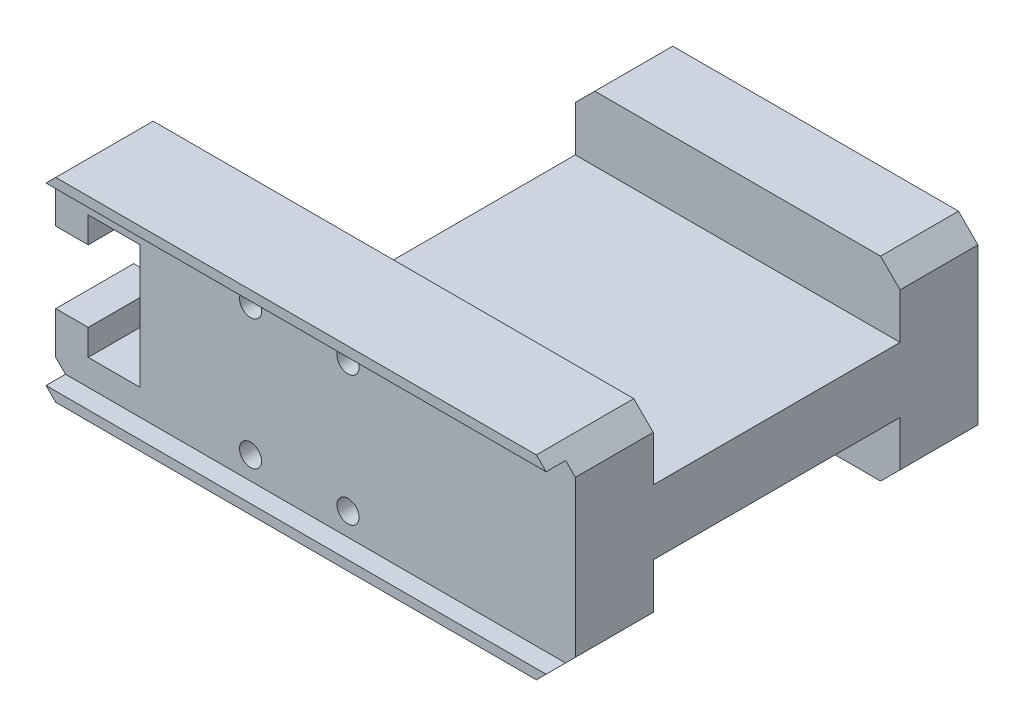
ISO-10303-21;
HEADER;
FILE_DESCRIPTION(('STEP AP214'),'2;1');
FILE_NAME('part.step','',(''),(''),'','','');
FILE_SCHEMA(('AUTOMOTIVE_DESIGN { 1 0 10303 214 1 1 1 1 }'));
ENDSEC;
DATA;
#1=APPLICATION_CONTEXT('core data for automotive mechanical design processes');
#2=APPLICATION_PROTOCOL_DEFINITION('international standard','automotive_design',2000,#1);
#3=PRODUCT_CONTEXT('',#1,'mechanical');
#4=PRODUCT('Part','Part','',(#3));
#5=PRODUCT_RELATED_PRODUCT_CATEGORY('part','',(#4));
#6=PRODUCT_DEFINITION_FORMATION('','',#4);
#7=PRODUCT_DEFINITION_CONTEXT('part definition',#1,'design');
#8=PRODUCT_DEFINITION('design','',#6,#7);
#9=PRODUCT_DEFINITION_SHAPE('','',#8);
#10=(LENGTH_UNIT() NAMED_UNIT(*) SI_UNIT(.MILLI.,.METRE.));
#11=(NAMED_UNIT(*) PLANE_ANGLE_UNIT() SI_UNIT($,.RADIAN.));
#12=(NAMED_UNIT(*) SI_UNIT($,.STERADIAN.) SOLID_ANGLE_UNIT());
#13=UNCERTAINTY_MEASURE_WITH_UNIT(LENGTH_MEASURE(1.E-05),#10,'distance_accuracy_value','');
#14=(GEOMETRIC_REPRESENTATION_CONTEXT(3) GLOBAL_UNCERTAINTY_ASSIGNED_CONTEXT((#13)) GLOBAL_UNIT_ASSIGNED_CONTEXT((#10,
#11,#12)) REPRESENTATION_CONTEXT('',''));
#15=CARTESIAN_POINT('',(0.,0.,0.));
#16=DIRECTION('',(0.,0.,1.));
#17=DIRECTION('',(1.,0.,0.));
#18=AXIS2_PLACEMENT_3D('',#15,#16,#17);
#19=CARTESIAN_POINT('',(-40.,15.,32.5));
#20=DIRECTION('',(0.,-1.,0.));
#21=DIRECTION('',(0.,0.,-1.));
#22=AXIS2_PLACEMENT_3D('',#19,#20,#21);
#23=PLANE('',#22);
#24=DIRECTION('',(-1.,0.,0.));
#25=VECTOR('',#24,1.);
#26=CARTESIAN_POINT('',(-40.,15.,-32.5));
#27=LINE('',#26,#25);
#28=CARTESIAN_POINT('',(37.,15.,-32.5));
#29=VERTEX_POINT('',#28);
#30=CARTESIAN_POINT('',(-6.99999999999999,15.,-32.5));
#31=VERTEX_POINT('',#30);
#32=EDGE_CURVE('E407',#29,#31,#27,.T.);
#33=ORIENTED_EDGE('',*,*,#32,.T.);
#34=DIRECTION('',(0.,0.,1.));
#35=VECTOR('',#34,1.);
#36=CARTESIAN_POINT('',(-6.99999999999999,15.,-20.5));
#37=LINE('',#36,#35);
#38=CARTESIAN_POINT('',(-6.99999999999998,15.,-20.5));
#39=VERTEX_POINT('',#38);
#40=EDGE_CURVE('E456',#31,#39,#37,.T.);
#41=ORIENTED_EDGE('',*,*,#40,.T.);
#42=DIRECTION('',(1.,0.,0.));
#43=VECTOR('',#42,1.);
#44=CARTESIAN_POINT('',(-51.8579962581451,15.,-20.5));
#45=LINE('',#44,#43);
#46=CARTESIAN_POINT('',(37.,15.,-20.5));
#47=VERTEX_POINT('',#46);
#48=EDGE_CURVE('E278',#39,#47,#45,.T.);
#49=ORIENTED_EDGE('',*,*,#48,.T.);
#50=DIRECTION('',(0.,0.,-1.));
#51=VECTOR('',#50,1.);
#52=CARTESIAN_POINT('',(37.,15.,32.5));
#53=LINE('',#52,#51);
#54=EDGE_CURVE('E453',#47,#29,#53,.T.);
#55=ORIENTED_EDGE('',*,*,#54,.T.);
#56=EDGE_LOOP('',(#33,#41,#49,#55));
#57=FACE_BOUND('',#56,.T.);
#58=ADVANCED_FACE('F37',(#57),#23,.F.);
#59=CARTESIAN_POINT('',(-27.,-9.5,32.5));
#60=DIRECTION('',(1.,0.,0.));
#61=DIRECTION('',(0.,0.,-1.));
#62=AXIS2_PLACEMENT_3D('',#59,#60,#61);
#63=PLANE('',#62);
#64=DIRECTION('',(0.,0.,-1.));
#65=VECTOR('',#64,1.);
#66=CARTESIAN_POINT('',(-27.,9.5,32.5));
#67=LINE('',#66,#65);
#68=CARTESIAN_POINT('',(-27.,9.5,29.5));
#69=VERTEX_POINT('',#68);
#70=CARTESIAN_POINT('',(-27.,9.5,17.5));
#71=VERTEX_POINT('',#70);
#72=EDGE_CURVE('E357',#69,#71,#67,.T.);
#73=ORIENTED_EDGE('',*,*,#72,.T.);
#74=DIRECTION('',(0.,-1.,0.));
#75=VECTOR('',#74,1.);
#76=CARTESIAN_POINT('',(-27.,-9.5,17.5));
#77=LINE('',#76,#75);
#78=CARTESIAN_POINT('',(-27.,-9.5,17.5));
#79=VERTEX_POINT('',#78);
#80=EDGE_CURVE('E329',#71,#79,#77,.T.);
#81=ORIENTED_EDGE('',*,*,#80,.T.);
#82=DIRECTION('',(0.,0.,-1.));
#83=VECTOR('',#82,1.);
#84=CARTESIAN_POINT('',(-27.,-9.5,32.5));
#85=LINE('',#84,#83);
#86=CARTESIAN_POINT('',(-27.,-9.5,29.5));
#87=VERTEX_POINT('',#86);
#88=EDGE_CURVE('E354',#87,#79,#85,.T.);
#89=ORIENTED_EDGE('',*,*,#88,.F.);
#90=DIRECTION('',(0.,-1.,0.));
#91=VECTOR('',#90,1.);
#92=CARTESIAN_POINT('',(-27.,13.5,29.5));
#93=LINE('',#92,#91);
#94=EDGE_CURVE('E428',#69,#87,#93,.T.);
#95=ORIENTED_EDGE('',*,*,#94,.F.);
#96=EDGE_LOOP('',(#73,#81,#89,#95));
#97=FACE_BOUND('',#96,.T.);
#98=ADVANCED_FACE('F579',(#97),#63,.F.);
#99=CARTESIAN_POINT('',(-40.,-15.,32.5));
#100=DIRECTION('',(0.,1.,0.));
#101=DIRECTION('',(0.,0.,1.));
#102=AXIS2_PLACEMENT_3D('',#99,#100,#101);
#103=PLANE('',#102);
#104=DIRECTION('',(1.,0.,0.));
#105=VECTOR('',#104,1.);
#106=CARTESIAN_POINT('',(-51.8579962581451,-15.,-20.5));
#107=LINE('',#106,#105);
#108=CARTESIAN_POINT('',(-6.99999999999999,-15.,-20.5));
#109=VERTEX_POINT('',#108);
#110=CARTESIAN_POINT('',(37.,-15.,-20.5));
#111=VERTEX_POINT('',#110);
#112=EDGE_CURVE('E307',#109,#111,#107,.T.);
#113=ORIENTED_EDGE('',*,*,#112,.F.);
#114=DIRECTION('',(0.,0.,-1.));
#115=VECTOR('',#114,1.);
#116=CARTESIAN_POINT('',(-6.99999999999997,-15.,-32.5));
#117=LINE('',#116,#115);
#118=CARTESIAN_POINT('',(-6.99999999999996,-15.,-32.5));
#119=VERTEX_POINT('',#118);
#120=EDGE_CURVE('E468',#109,#119,#117,.T.);
#121=ORIENTED_EDGE('',*,*,#120,.T.);
#122=DIRECTION('',(1.,0.,0.));
#123=VECTOR('',#122,1.);
#124=CARTESIAN_POINT('',(-40.,-15.,-32.5));
#125=LINE('',#124,#123);
#126=CARTESIAN_POINT('',(37.,-15.,-32.5));
#127=VERTEX_POINT('',#126);
#128=EDGE_CURVE('E402',#119,#127,#125,.T.);
#129=ORIENTED_EDGE('',*,*,#128,.T.);
#130=DIRECTION('',(0.,0.,1.));
#131=VECTOR('',#130,1.);
#132=CARTESIAN_POINT('',(37.,-15.,32.5));
#133=LINE('',#132,#131);
#134=EDGE_CURVE('E466',#127,#111,#133,.T.);
#135=ORIENTED_EDGE('',*,*,#134,.T.);
#136=EDGE_LOOP('',(#113,#121,#129,#135));
#137=FACE_BOUND('',#136,.T.);
#138=ADVANCED_FACE('F556',(#137),#103,.F.);
#139=CARTESIAN_POINT('',(40.,15.,-32.5));
#140=DIRECTION('',(0.,0.,-1.));
#141=DIRECTION('',(-1.,0.,0.));
#142=AXIS2_PLACEMENT_3D('',#139,#140,#141);
#143=PLANE('',#142);
#144=CARTESIAN_POINT('',(10.,0.,-32.5));
#145=DIRECTION('',(0.,0.,-1.));
#146=DIRECTION('',(-1.,0.,0.));
#147=AXIS2_PLACEMENT_3D('',#144,#145,#146);
#148=CIRCLE('',#147,2.1);
#149=CARTESIAN_POINT('',(7.90000000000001,0.,-32.5));
#150=VERTEX_POINT('',#149);
#151=EDGE_CURVE('E343',#150,#150,#148,.T.);
#152=ORIENTED_EDGE('',*,*,#151,.F.);
#153=EDGE_LOOP('',(#152));
#154=FACE_BOUND('',#153,.T.);
#155=DIRECTION('',(0.,1.,0.));
#156=VECTOR('',#155,1.);
#157=CARTESIAN_POINT('',(-9.99999999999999,42.714272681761,-32.5));
#158=LINE('',#157,#156);
#159=CARTESIAN_POINT('',(-9.99999999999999,-12.,-32.5));
#160=VERTEX_POINT('',#159);
#161=CARTESIAN_POINT('',(-9.99999999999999,12.,-32.5));
#162=VERTEX_POINT('',#161);
#163=EDGE_CURVE('E262',#160,#162,#158,.T.);
#164=ORIENTED_EDGE('',*,*,#163,.T.);
#165=DIRECTION('',(0.707106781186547,0.707106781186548,0.));
#166=VECTOR('',#165,1.);
#167=CARTESIAN_POINT('',(16.5,38.5,-32.5));
#168=LINE('',#167,#166);
#169=EDGE_CURVE('E451',#162,#31,#168,.T.);
#170=ORIENTED_EDGE('',*,*,#169,.T.);
#171=ORIENTED_EDGE('',*,*,#32,.F.);
#172=DIRECTION('',(-0.707106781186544,0.707106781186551,0.));
#173=VECTOR('',#172,1.);
#174=CARTESIAN_POINT('',(38.5,13.5,-32.5));
#175=LINE('',#174,#173);
#176=CARTESIAN_POINT('',(40.,12.,-32.5));
#177=VERTEX_POINT('',#176);
#178=EDGE_CURVE('E447',#29,#177,#175,.F.);
#179=ORIENTED_EDGE('',*,*,#178,.T.);
#180=DIRECTION('',(0.,1.,0.));
#181=VECTOR('',#180,1.);
#182=CARTESIAN_POINT('',(40.,-15.,-32.5));
#183=LINE('',#182,#181);
#184=CARTESIAN_POINT('',(40.,-12.,-32.5));
#185=VERTEX_POINT('',#184);
#186=EDGE_CURVE('E397',#185,#177,#183,.T.);
#187=ORIENTED_EDGE('',*,*,#186,.F.);
#188=DIRECTION('',(0.707106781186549,0.707106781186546,0.));
#189=VECTOR('',#188,1.);
#190=CARTESIAN_POINT('',(53.5,1.49999999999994,-32.5));
#191=LINE('',#190,#189);
#192=EDGE_CURVE('E445',#185,#127,#191,.F.);
#193=ORIENTED_EDGE('',*,*,#192,.T.);
#194=ORIENTED_EDGE('',*,*,#128,.F.);
#195=DIRECTION('',(-0.707106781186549,0.707106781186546,0.));
#196=VECTOR('',#195,1.);
#197=CARTESIAN_POINT('',(1.50000000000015,-23.5000000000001,-32.5));
#198=LINE('',#197,#196);
#199=EDGE_CURVE('E449',#119,#160,#198,.T.);
#200=ORIENTED_EDGE('',*,*,#199,.T.);
#201=EDGE_LOOP('',(#164,#170,#171,#179,#187,#193,#194,#200));
#202=FACE_BOUND('',#201,.T.);
#203=ADVANCED_FACE('F552',(#154,#202),#143,.T.);
#204=CARTESIAN_POINT('',(-51.8579962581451,-5.,-20.5));
#205=DIRECTION('',(0.,-1.,0.));
#206=DIRECTION('',(0.,0.,-1.));
#207=AXIS2_PLACEMENT_3D('',#204,#205,#206);
#208=PLANE('',#207);
#209=DIRECTION('',(-1.,0.,0.));
#210=VECTOR('',#209,1.);
#211=CARTESIAN_POINT('',(-51.8579962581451,-5.,17.5));
#212=LINE('',#211,#210);
#213=CARTESIAN_POINT('',(40.,-5.,17.5));
#214=VERTEX_POINT('',#213);
#215=CARTESIAN_POINT('',(-9.99999999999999,-5.,17.5));
#216=VERTEX_POINT('',#215);
#217=EDGE_CURVE('E310',#214,#216,#212,.T.);
#218=ORIENTED_EDGE('',*,*,#217,.T.);
#219=DIRECTION('',(0.,0.,-1.));
#220=VECTOR('',#219,1.);
#221=CARTESIAN_POINT('',(-9.99999999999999,-5.,-20.5));
#222=LINE('',#221,#220);
#223=CARTESIAN_POINT('',(-9.99999999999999,-5.,-20.5));
#224=VERTEX_POINT('',#223);
#225=EDGE_CURVE('E256',#216,#224,#222,.T.);
#226=ORIENTED_EDGE('',*,*,#225,.T.);
#227=DIRECTION('',(1.,0.,0.));
#228=VECTOR('',#227,1.);
#229=CARTESIAN_POINT('',(-51.8579962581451,-5.,-20.5));
#230=LINE('',#229,#228);
#231=CARTESIAN_POINT('',(40.,-5.,-20.5));
#232=VERTEX_POINT('',#231);
#233=EDGE_CURVE('E308',#224,#232,#230,.T.);
#234=ORIENTED_EDGE('',*,*,#233,.T.);
#235=DIRECTION('',(0.,0.,1.));
#236=VECTOR('',#235,1.);
#237=CARTESIAN_POINT('',(40.,-5.,32.5));
#238=LINE('',#237,#236);
#239=EDGE_CURVE('E340',#232,#214,#238,.T.);
#240=ORIENTED_EDGE('',*,*,#239,.T.);
#241=EDGE_LOOP('',(#218,#226,#234,#240));
#242=FACE_BOUND('',#241,.T.);
#243=ADVANCED_FACE('F539',(#242),#208,.T.);
#244=CARTESIAN_POINT('',(-51.8579962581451,-5.,-20.5));
#245=DIRECTION('',(0.,0.,-1.));
#246=DIRECTION('',(-1.,0.,0.));
#247=AXIS2_PLACEMENT_3D('',#244,#245,#246);
#248=PLANE('',#247);
#249=DIRECTION('',(0.,1.,0.));
#250=VECTOR('',#249,1.);
#251=CARTESIAN_POINT('',(-9.99999999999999,-4.99999999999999,-20.5));
#252=LINE('',#251,#250);
#253=CARTESIAN_POINT('',(-9.99999999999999,-12.,-20.5));
#254=VERTEX_POINT('',#253);
#255=EDGE_CURVE('E271',#254,#224,#252,.T.);
#256=ORIENTED_EDGE('',*,*,#255,.F.);
#257=DIRECTION('',(0.707106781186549,-0.707106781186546,0.));
#258=VECTOR('',#257,1.);
#259=CARTESIAN_POINT('',(-9.99999999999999,-12.,-20.5));
#260=LINE('',#259,#258);
#261=EDGE_CURVE('E464',#254,#109,#260,.T.);
#262=ORIENTED_EDGE('',*,*,#261,.T.);
#263=ORIENTED_EDGE('',*,*,#112,.T.);
#264=DIRECTION('',(-0.707106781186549,-0.707106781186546,0.));
#265=VECTOR('',#264,1.);
#266=CARTESIAN_POINT('',(40.,-12.,-20.5));
#267=LINE('',#266,#265);
#268=CARTESIAN_POINT('',(40.,-12.,-20.5));
#269=VERTEX_POINT('',#268);
#270=EDGE_CURVE('E462',#111,#269,#267,.F.);
#271=ORIENTED_EDGE('',*,*,#270,.T.);
#272=DIRECTION('',(0.,-1.,0.));
#273=VECTOR('',#272,1.);
#274=CARTESIAN_POINT('',(40.,-15.,-20.5));
#275=LINE('',#274,#273);
#276=EDGE_CURVE('E313',#232,#269,#275,.T.);
#277=ORIENTED_EDGE('',*,*,#276,.F.);
#278=ORIENTED_EDGE('',*,*,#233,.F.);
#279=EDGE_LOOP('',(#256,#262,#263,#271,#277,#278));
#280=FACE_BOUND('',#279,.T.);
#281=ADVANCED_FACE('F566',(#280),#248,.F.);
#282=CARTESIAN_POINT('',(-51.8579962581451,5.,-20.5));
#283=DIRECTION('',(0.,1.,0.));
#284=DIRECTION('',(0.,0.,-1.));
#285=AXIS2_PLACEMENT_3D('',#282,#283,#284);
#286=PLANE('',#285);
#287=DIRECTION('',(1.,0.,0.));
#288=VECTOR('',#287,1.);
#289=CARTESIAN_POINT('',(-51.8579962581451,5.,-20.5));
#290=LINE('',#289,#288);
#291=CARTESIAN_POINT('',(-10.,5.,-20.5));
#292=VERTEX_POINT('',#291);
#293=CARTESIAN_POINT('',(40.,5.,-20.5));
#294=VERTEX_POINT('',#293);
#295=EDGE_CURVE('E270',#292,#294,#290,.T.);
#296=ORIENTED_EDGE('',*,*,#295,.F.);
#297=DIRECTION('',(0.,0.,1.));
#298=VECTOR('',#297,1.);
#299=CARTESIAN_POINT('',(-9.99999999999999,5.,-20.5));
#300=LINE('',#299,#298);
#301=CARTESIAN_POINT('',(-9.99999999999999,5.,17.5));
#302=VERTEX_POINT('',#301);
#303=EDGE_CURVE('E253',#292,#302,#300,.T.);
#304=ORIENTED_EDGE('',*,*,#303,.T.);
#305=DIRECTION('',(-1.,0.,0.));
#306=VECTOR('',#305,1.);
#307=CARTESIAN_POINT('',(-51.8579962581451,5.,17.5));
#308=LINE('',#307,#306);
#309=CARTESIAN_POINT('',(40.,5.,17.5));
#310=VERTEX_POINT('',#309);
#311=EDGE_CURVE('E268',#310,#302,#308,.T.);
#312=ORIENTED_EDGE('',*,*,#311,.F.);
#313=DIRECTION('',(0.,0.,-1.));
#314=VECTOR('',#313,1.);
#315=CARTESIAN_POINT('',(40.,5.,32.5));
#316=LINE('',#315,#314);
#317=EDGE_CURVE('E305',#310,#294,#316,.T.);
#318=ORIENTED_EDGE('',*,*,#317,.T.);
#319=EDGE_LOOP('',(#296,#304,#312,#318));
#320=FACE_BOUND('',#319,.T.);
#321=ADVANCED_FACE('F266',(#320),#286,.T.);
#322=CARTESIAN_POINT('',(-51.8579962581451,5.,-20.5));
#323=DIRECTION('',(0.,0.,1.));
#324=DIRECTION('',(1.,0.,0.));
#325=AXIS2_PLACEMENT_3D('',#322,#323,#324);
#326=PLANE('',#325);
#327=ORIENTED_EDGE('',*,*,#48,.F.);
#328=DIRECTION('',(-0.707106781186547,-0.707106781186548,0.));
#329=VECTOR('',#328,1.);
#330=CARTESIAN_POINT('',(-34.4289981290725,-12.4289981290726,-20.5));
#331=LINE('',#330,#329);
#332=CARTESIAN_POINT('',(-9.99999999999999,12.,-20.5));
#333=VERTEX_POINT('',#332);
#334=EDGE_CURVE('E460',#39,#333,#331,.T.);
#335=ORIENTED_EDGE('',*,*,#334,.T.);
#336=DIRECTION('',(0.,-1.,0.));
#337=VECTOR('',#336,1.);
#338=CARTESIAN_POINT('',(-9.99999999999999,5.,-20.5));
#339=LINE('',#338,#337);
#340=EDGE_CURVE('E261',#333,#292,#339,.T.);
#341=ORIENTED_EDGE('',*,*,#340,.T.);
#342=ORIENTED_EDGE('',*,*,#295,.T.);
#343=DIRECTION('',(0.,1.,0.));
#344=VECTOR('',#343,1.);
#345=CARTESIAN_POINT('',(40.,-15.,-20.5));
#346=LINE('',#345,#344);
#347=CARTESIAN_POINT('',(40.,12.,-20.5));
#348=VERTEX_POINT('',#347);
#349=EDGE_CURVE('E302',#294,#348,#346,.T.);
#350=ORIENTED_EDGE('',*,*,#349,.T.);
#351=DIRECTION('',(0.707106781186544,-0.707106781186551,0.));
#352=VECTOR('',#351,1.);
#353=CARTESIAN_POINT('',(-2.42899812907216,54.4289981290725,-20.5));
#354=LINE('',#353,#352);
#355=EDGE_CURVE('E458',#348,#47,#354,.F.);
#356=ORIENTED_EDGE('',*,*,#355,.T.);
#357=EDGE_LOOP('',(#327,#335,#341,#342,#350,#356));
#358=FACE_BOUND('',#357,.T.);
#359=ADVANCED_FACE('F573',(#358),#326,.T.);
#360=CARTESIAN_POINT('',(40.,-15.,32.5));
#361=DIRECTION('',(-1.,0.,0.));
#362=DIRECTION('',(0.,0.,1.));
#363=AXIS2_PLACEMENT_3D('',#360,#361,#362);
#364=PLANE('',#363);
#365=ORIENTED_EDGE('',*,*,#186,.T.);
#366=DIRECTION('',(0.,0.,1.));
#367=VECTOR('',#366,1.);
#368=CARTESIAN_POINT('',(40.,12.,32.5));
#369=LINE('',#368,#367);
#370=EDGE_CURVE('E478',#177,#348,#369,.T.);
#371=ORIENTED_EDGE('',*,*,#370,.T.);
#372=ORIENTED_EDGE('',*,*,#349,.F.);
#373=ORIENTED_EDGE('',*,*,#317,.F.);
#374=DIRECTION('',(0.,-1.,0.));
#375=VECTOR('',#374,1.);
#376=CARTESIAN_POINT('',(40.,-15.,17.5));
#377=LINE('',#376,#375);
#378=CARTESIAN_POINT('',(40.,12.,17.5));
#379=VERTEX_POINT('',#378);
#380=EDGE_CURVE('E277',#379,#310,#377,.T.);
#381=ORIENTED_EDGE('',*,*,#380,.F.);
#382=DIRECTION('',(0.,0.,1.));
#383=VECTOR('',#382,1.);
#384=CARTESIAN_POINT('',(40.,12.,32.5));
#385=LINE('',#384,#383);
#386=CARTESIAN_POINT('',(40.,12.,29.5));
#387=VERTEX_POINT('',#386);
#388=EDGE_CURVE('E470',#379,#387,#385,.T.);
#389=ORIENTED_EDGE('',*,*,#388,.T.);
#390=DIRECTION('',(0.,-1.,0.));
#391=VECTOR('',#390,1.);
#392=CARTESIAN_POINT('',(40.,-15.,29.5));
#393=LINE('',#392,#391);
#394=CARTESIAN_POINT('',(40.,-12.,29.5));
#395=VERTEX_POINT('',#394);
#396=EDGE_CURVE('E394',#387,#395,#393,.T.);
#397=ORIENTED_EDGE('',*,*,#396,.T.);
#398=DIRECTION('',(0.,0.,-1.));
#399=VECTOR('',#398,1.);
#400=CARTESIAN_POINT('',(40.,-12.,32.5));
#401=LINE('',#400,#399);
#402=CARTESIAN_POINT('',(40.,-12.,17.5));
#403=VERTEX_POINT('',#402);
#404=EDGE_CURVE('E472',#395,#403,#401,.T.);
#405=ORIENTED_EDGE('',*,*,#404,.T.);
#406=DIRECTION('',(0.,1.,0.));
#407=VECTOR('',#406,1.);
#408=CARTESIAN_POINT('',(40.,-15.,17.5));
#409=LINE('',#408,#407);
#410=EDGE_CURVE('E338',#403,#214,#409,.T.);
#411=ORIENTED_EDGE('',*,*,#410,.T.);
#412=ORIENTED_EDGE('',*,*,#239,.F.);
#413=ORIENTED_EDGE('',*,*,#276,.T.);
#414=DIRECTION('',(0.,0.,-1.));
#415=VECTOR('',#414,1.);
#416=CARTESIAN_POINT('',(40.,-12.,32.5));
#417=LINE('',#416,#415);
#418=EDGE_CURVE('E475',#269,#185,#417,.T.);
#419=ORIENTED_EDGE('',*,*,#418,.T.);
#420=EDGE_LOOP('',(#365,#371,#372,#373,#381,#389,#397,#405,#411,#412,#413,#419));
#421=FACE_BOUND('',#420,.T.);
#422=ADVANCED_FACE('F535',(#421),#364,.F.);
#423=DIRECTION('',(-1.,0.,0.));
#424=VECTOR('',#423,1.);
#425=CARTESIAN_POINT('',(-51.8579962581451,15.,17.5));
#426=LINE('',#425,#424);
#427=CARTESIAN_POINT('',(37.,15.,17.5));
#428=VERTEX_POINT('',#427);
#429=CARTESIAN_POINT('',(-37.,15.,17.5));
#430=VERTEX_POINT('',#429);
#431=EDGE_CURVE('E283',#428,#430,#426,.T.);
#432=ORIENTED_EDGE('',*,*,#431,.T.);
#433=DIRECTION('',(0.,0.,1.));
#434=VECTOR('',#433,1.);
#435=CARTESIAN_POINT('',(-37.,15.,32.5));
#436=LINE('',#435,#434);
#437=CARTESIAN_POINT('',(-37.,15.,32.5));
#438=VERTEX_POINT('',#437);
#439=EDGE_CURVE('E494',#430,#438,#436,.T.);
#440=ORIENTED_EDGE('',*,*,#439,.T.);
#441=DIRECTION('',(-1.,0.,0.));
#442=VECTOR('',#441,1.);
#443=CARTESIAN_POINT('',(-40.,15.,32.5));
#444=LINE('',#443,#442);
#445=CARTESIAN_POINT('',(37.,15.,32.5));
#446=VERTEX_POINT('',#445);
#447=EDGE_CURVE('E398',#446,#438,#444,.T.);
#448=ORIENTED_EDGE('',*,*,#447,.F.);
#449=DIRECTION('',(0.,0.,-1.));
#450=VECTOR('',#449,1.);
#451=CARTESIAN_POINT('',(37.,15.,32.5));
#452=LINE('',#451,#450);
#453=EDGE_CURVE('E491',#446,#428,#452,.T.);
#454=ORIENTED_EDGE('',*,*,#453,.T.);
#455=EDGE_LOOP('',(#432,#440,#448,#454));
#456=FACE_BOUND('',#455,.T.);
#457=ADVANCED_FACE('F582',(#456),#23,.F.);
#458=CARTESIAN_POINT('',(-40.,-15.,32.5));
#459=DIRECTION('',(1.,0.,0.));
#460=DIRECTION('',(0.,0.,-1.));
#461=AXIS2_PLACEMENT_3D('',#458,#459,#460);
#462=PLANE('',#461);
#463=DIRECTION('',(0.,1.,0.));
#464=VECTOR('',#463,1.);
#465=CARTESIAN_POINT('',(-40.,-15.,29.5));
#466=LINE('',#465,#464);
#467=CARTESIAN_POINT('',(-40.,5.5,29.5));
#468=VERTEX_POINT('',#467);
#469=CARTESIAN_POINT('',(-40.,12.,29.5));
#470=VERTEX_POINT('',#469);
#471=EDGE_CURVE('E416',#468,#470,#466,.T.);
#472=ORIENTED_EDGE('',*,*,#471,.T.);
#473=DIRECTION('',(0.,0.,-1.));
#474=VECTOR('',#473,1.);
#475=CARTESIAN_POINT('',(-40.,12.,32.5));
#476=LINE('',#475,#474);
#477=CARTESIAN_POINT('',(-40.,12.,17.5));
#478=VERTEX_POINT('',#477);
#479=EDGE_CURVE('E480',#470,#478,#476,.T.);
#480=ORIENTED_EDGE('',*,*,#479,.T.);
#481=DIRECTION('',(0.,1.,0.));
#482=VECTOR('',#481,1.);
#483=CARTESIAN_POINT('',(-40.,-15.,17.5));
#484=LINE('',#483,#482);
#485=CARTESIAN_POINT('',(-40.,5.5,17.5));
#486=VERTEX_POINT('',#485);
#487=EDGE_CURVE('E293',#486,#478,#484,.T.);
#488=ORIENTED_EDGE('',*,*,#487,.F.);
#489=DIRECTION('',(0.,0.,1.));
#490=VECTOR('',#489,1.);
#491=CARTESIAN_POINT('',(-40.,5.5,32.5));
#492=LINE('',#491,#490);
#493=EDGE_CURVE('E368',#486,#468,#492,.T.);
#494=ORIENTED_EDGE('',*,*,#493,.T.);
#495=EDGE_LOOP('',(#472,#480,#488,#494));
#496=FACE_BOUND('',#495,.T.);
#497=ADVANCED_FACE('F591',(#496),#462,.F.);
#498=CARTESIAN_POINT('',(-10.,10.,29.5));
#499=DIRECTION('',(0.,0.,1.));
#500=DIRECTION('',(1.,0.,0.));
#501=AXIS2_PLACEMENT_3D('',#498,#499,#500);
#502=CYLINDRICAL_SURFACE('',#501,1.7);
#503=CARTESIAN_POINT('',(-10.,10.,29.5));
#504=DIRECTION('',(0.,0.,1.));
#505=DIRECTION('',(1.,0.,0.));
#506=AXIS2_PLACEMENT_3D('',#503,#504,#505);
#507=CIRCLE('',#506,1.7);
#508=CARTESIAN_POINT('',(-8.3,10.,29.5));
#509=VERTEX_POINT('',#508);
#510=EDGE_CURVE('E379',#509,#509,#507,.T.);
#511=ORIENTED_EDGE('',*,*,#510,.T.);
#512=EDGE_LOOP('',(#511));
#513=FACE_BOUND('',#512,.T.);
#514=CARTESIAN_POINT('',(-10.,10.,17.5));
#515=DIRECTION('',(0.,0.,-1.));
#516=DIRECTION('',(-1.,0.,0.));
#517=AXIS2_PLACEMENT_3D('',#514,#515,#516);
#518=CIRCLE('',#517,1.7);
#519=CARTESIAN_POINT('',(-11.7,10.,17.5));
#520=VERTEX_POINT('',#519);
#521=EDGE_CURVE('E298',#520,#520,#518,.F.);
#522=ORIENTED_EDGE('',*,*,#521,.F.);
#523=EDGE_LOOP('',(#522));
#524=FACE_BOUND('',#523,.T.);
#525=ADVANCED_FACE('F597',(#513,#524),#502,.F.);
#526=CARTESIAN_POINT('',(5.,10.,29.5));
#527=DIRECTION('',(0.,0.,1.));
#528=DIRECTION('',(1.,0.,0.));
#529=AXIS2_PLACEMENT_3D('',#526,#527,#528);
#530=CYLINDRICAL_SURFACE('',#529,1.7);
#531=CARTESIAN_POINT('',(5.,10.,29.5));
#532=DIRECTION('',(0.,0.,1.));
#533=DIRECTION('',(1.,0.,0.));
#534=AXIS2_PLACEMENT_3D('',#531,#532,#533);
#535=CIRCLE('',#534,1.7);
#536=CARTESIAN_POINT('',(6.7,10.,29.5));
#537=VERTEX_POINT('',#536);
#538=EDGE_CURVE('E376',#537,#537,#535,.T.);
#539=ORIENTED_EDGE('',*,*,#538,.T.);
#540=EDGE_LOOP('',(#539));
#541=FACE_BOUND('',#540,.T.);
#542=CARTESIAN_POINT('',(5.,10.,17.5));
#543=DIRECTION('',(0.,0.,-1.));
#544=DIRECTION('',(-1.,0.,0.));
#545=AXIS2_PLACEMENT_3D('',#542,#543,#544);
#546=CIRCLE('',#545,1.7);
#547=CARTESIAN_POINT('',(3.3,10.,17.5));
#548=VERTEX_POINT('',#547);
#549=EDGE_CURVE('E295',#548,#548,#546,.F.);
#550=ORIENTED_EDGE('',*,*,#549,.F.);
#551=EDGE_LOOP('',(#550));
#552=FACE_BOUND('',#551,.T.);
#553=ADVANCED_FACE('F856',(#541,#552),#530,.F.);
#554=CARTESIAN_POINT('',(-35.,5.5,32.5));
#555=DIRECTION('',(0.,1.,0.));
#556=DIRECTION('',(0.,0.,1.));
#557=AXIS2_PLACEMENT_3D('',#554,#555,#556);
#558=PLANE('',#557);
#559=DIRECTION('',(-1.,0.,0.));
#560=VECTOR('',#559,1.);
#561=CARTESIAN_POINT('',(-35.,5.5,17.5));
#562=LINE('',#561,#560);
#563=CARTESIAN_POINT('',(-35.,5.5,17.5));
#564=VERTEX_POINT('',#563);
#565=EDGE_CURVE('E291',#564,#486,#562,.T.);
#566=ORIENTED_EDGE('',*,*,#565,.F.);
#567=DIRECTION('',(0.,0.,-1.));
#568=VECTOR('',#567,1.);
#569=CARTESIAN_POINT('',(-35.,5.5,32.5));
#570=LINE('',#569,#568);
#571=CARTESIAN_POINT('',(-35.,5.5,29.5));
#572=VERTEX_POINT('',#571);
#573=EDGE_CURVE('E369',#572,#564,#570,.T.);
#574=ORIENTED_EDGE('',*,*,#573,.F.);
#575=DIRECTION('',(1.,0.,0.));
#576=VECTOR('',#575,1.);
#577=CARTESIAN_POINT('',(70.0409014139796,5.5,29.5));
#578=LINE('',#577,#576);
#579=EDGE_CURVE('E419',#468,#572,#578,.T.);
#580=ORIENTED_EDGE('',*,*,#579,.F.);
#581=ORIENTED_EDGE('',*,*,#493,.F.);
#582=EDGE_LOOP('',(#566,#574,#580,#581));
#583=FACE_BOUND('',#582,.T.);
#584=ADVANCED_FACE('F892',(#583),#558,.F.);
#585=CARTESIAN_POINT('',(-27.,9.5,32.5));
#586=DIRECTION('',(0.,1.,0.));
#587=DIRECTION('',(0.,0.,1.));
#588=AXIS2_PLACEMENT_3D('',#585,#586,#587);
#589=PLANE('',#588);
#590=DIRECTION('',(-1.,0.,0.));
#591=VECTOR('',#590,1.);
#592=CARTESIAN_POINT('',(-27.,9.5,17.5));
#593=LINE('',#592,#591);
#594=CARTESIAN_POINT('',(-35.,9.5,17.5));
#595=VERTEX_POINT('',#594);
#596=EDGE_CURVE('E280',#71,#595,#593,.T.);
#597=ORIENTED_EDGE('',*,*,#596,.F.);
#598=ORIENTED_EDGE('',*,*,#72,.F.);
#599=DIRECTION('',(1.,0.,0.));
#600=VECTOR('',#599,1.);
#601=CARTESIAN_POINT('',(70.0409014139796,9.5,29.5));
#602=LINE('',#601,#600);
#603=CARTESIAN_POINT('',(-35.,9.5,29.5));
#604=VERTEX_POINT('',#603);
#605=EDGE_CURVE('E425',#604,#69,#602,.T.);
#606=ORIENTED_EDGE('',*,*,#605,.F.);
#607=DIRECTION('',(0.,0.,-1.));
#608=VECTOR('',#607,1.);
#609=CARTESIAN_POINT('',(-35.,9.5,32.5));
#610=LINE('',#609,#608);
#611=EDGE_CURVE('E349',#604,#595,#610,.T.);
#612=ORIENTED_EDGE('',*,*,#611,.T.);
#613=EDGE_LOOP('',(#597,#598,#606,#612));
#614=FACE_BOUND('',#613,.T.);
#615=ADVANCED_FACE('F882',(#614),#589,.F.);
#616=CARTESIAN_POINT('',(-35.,-9.5,32.5));
#617=DIRECTION('',(-1.,0.,0.));
#618=DIRECTION('',(0.,0.,1.));
#619=AXIS2_PLACEMENT_3D('',#616,#617,#618);
#620=PLANE('',#619);
#621=DIRECTION('',(0.,-1.,0.));
#622=VECTOR('',#621,1.);
#623=CARTESIAN_POINT('',(-35.,-9.5,17.5));
#624=LINE('',#623,#622);
#625=EDGE_CURVE('E437',#595,#564,#624,.T.);
#626=ORIENTED_EDGE('',*,*,#625,.F.);
#627=ORIENTED_EDGE('',*,*,#611,.F.);
#628=DIRECTION('',(0.,1.,0.));
#629=VECTOR('',#628,1.);
#630=CARTESIAN_POINT('',(-35.,13.5,29.5));
#631=LINE('',#630,#629);
#632=EDGE_CURVE('E353',#572,#604,#631,.T.);
#633=ORIENTED_EDGE('',*,*,#632,.F.);
#634=ORIENTED_EDGE('',*,*,#573,.T.);
#635=EDGE_LOOP('',(#626,#627,#633,#634));
#636=FACE_BOUND('',#635,.T.);
#637=ADVANCED_FACE('F781',(#636),#620,.F.);
#638=DIRECTION('',(0.,-1.,0.));
#639=VECTOR('',#638,1.);
#640=CARTESIAN_POINT('',(-40.,-15.,17.5));
#641=LINE('',#640,#639);
#642=CARTESIAN_POINT('',(-40.,-5.5,17.5));
#643=VERTEX_POINT('',#642);
#644=CARTESIAN_POINT('',(-40.,-12.,17.5));
#645=VERTEX_POINT('',#644);
#646=EDGE_CURVE('E326',#643,#645,#641,.T.);
#647=ORIENTED_EDGE('',*,*,#646,.T.);
#648=DIRECTION('',(0.,0.,1.));
#649=VECTOR('',#648,1.);
#650=CARTESIAN_POINT('',(-40.,-12.,32.5));
#651=LINE('',#650,#649);
#652=CARTESIAN_POINT('',(-40.,-12.,29.5));
#653=VERTEX_POINT('',#652);
#654=EDGE_CURVE('E517',#645,#653,#651,.T.);
#655=ORIENTED_EDGE('',*,*,#654,.T.);
#656=CARTESIAN_POINT('',(-40.,-5.5,29.5));
#657=VERTEX_POINT('',#656);
#658=EDGE_CURVE('E417',#653,#657,#466,.T.);
#659=ORIENTED_EDGE('',*,*,#658,.T.);
#660=DIRECTION('',(0.,0.,-1.));
#661=VECTOR('',#660,1.);
#662=CARTESIAN_POINT('',(-40.,-5.5,32.5));
#663=LINE('',#662,#661);
#664=EDGE_CURVE('E373',#657,#643,#663,.T.);
#665=ORIENTED_EDGE('',*,*,#664,.T.);
#666=EDGE_LOOP('',(#647,#655,#659,#665));
#667=FACE_BOUND('',#666,.T.);
#668=ADVANCED_FACE('F599',(#667),#462,.F.);
#669=DIRECTION('',(1.,0.,0.));
#670=VECTOR('',#669,1.);
#671=CARTESIAN_POINT('',(-40.,-15.,32.5));
#672=LINE('',#671,#670);
#673=CARTESIAN_POINT('',(-37.,-15.,32.5));
#674=VERTEX_POINT('',#673);
#675=CARTESIAN_POINT('',(37.,-15.,32.5));
#676=VERTEX_POINT('',#675);
#677=EDGE_CURVE('E401',#674,#676,#672,.T.);
#678=ORIENTED_EDGE('',*,*,#677,.F.);
#679=DIRECTION('',(0.,0.,-1.));
#680=VECTOR('',#679,1.);
#681=CARTESIAN_POINT('',(-37.,-15.,32.5));
#682=LINE('',#681,#680);
#683=CARTESIAN_POINT('',(-37.,-15.,17.5));
#684=VERTEX_POINT('',#683);
#685=EDGE_CURVE('E514',#674,#684,#682,.T.);
#686=ORIENTED_EDGE('',*,*,#685,.T.);
#687=DIRECTION('',(-1.,0.,0.));
#688=VECTOR('',#687,1.);
#689=CARTESIAN_POINT('',(-51.8579962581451,-15.,17.5));
#690=LINE('',#689,#688);
#691=CARTESIAN_POINT('',(37.,-15.,17.5));
#692=VERTEX_POINT('',#691);
#693=EDGE_CURVE('E311',#692,#684,#690,.T.);
#694=ORIENTED_EDGE('',*,*,#693,.F.);
#695=DIRECTION('',(0.,0.,1.));
#696=VECTOR('',#695,1.);
#697=CARTESIAN_POINT('',(37.,-15.,32.5));
#698=LINE('',#697,#696);
#699=EDGE_CURVE('E512',#692,#676,#698,.T.);
#700=ORIENTED_EDGE('',*,*,#699,.T.);
#701=EDGE_LOOP('',(#678,#686,#694,#700));
#702=FACE_BOUND('',#701,.T.);
#703=ADVANCED_FACE('F764',(#702),#103,.F.);
#704=CARTESIAN_POINT('',(-35.,-5.5,32.5));
#705=DIRECTION('',(0.,-1.,0.));
#706=DIRECTION('',(0.,0.,-1.));
#707=AXIS2_PLACEMENT_3D('',#704,#705,#706);
#708=PLANE('',#707);
#709=DIRECTION('',(0.,0.,-1.));
#710=VECTOR('',#709,1.);
#711=CARTESIAN_POINT('',(-35.,-5.5,32.5));
#712=LINE('',#711,#710);
#713=CARTESIAN_POINT('',(-35.,-5.5,29.5));
#714=VERTEX_POINT('',#713);
#715=CARTESIAN_POINT('',(-35.,-5.5,17.5));
#716=VERTEX_POINT('',#715);
#717=EDGE_CURVE('E365',#714,#716,#712,.T.);
#718=ORIENTED_EDGE('',*,*,#717,.T.);
#719=DIRECTION('',(-1.,0.,0.));
#720=VECTOR('',#719,1.);
#721=CARTESIAN_POINT('',(-35.,-5.5,17.5));
#722=LINE('',#721,#720);
#723=EDGE_CURVE('E323',#716,#643,#722,.T.);
#724=ORIENTED_EDGE('',*,*,#723,.T.);
#725=ORIENTED_EDGE('',*,*,#664,.F.);
#726=DIRECTION('',(-1.,0.,0.));
#727=VECTOR('',#726,1.);
#728=CARTESIAN_POINT('',(70.0409014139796,-5.5,29.5));
#729=LINE('',#728,#727);
#730=EDGE_CURVE('E422',#714,#657,#729,.T.);
#731=ORIENTED_EDGE('',*,*,#730,.F.);
#732=EDGE_LOOP('',(#718,#724,#725,#731));
#733=FACE_BOUND('',#732,.T.);
#734=ADVANCED_FACE('F769',(#733),#708,.F.);
#735=CARTESIAN_POINT('',(-27.,-9.5,32.5));
#736=DIRECTION('',(0.,-1.,0.));
#737=DIRECTION('',(0.,0.,-1.));
#738=AXIS2_PLACEMENT_3D('',#735,#736,#737);
#739=PLANE('',#738);
#740=ORIENTED_EDGE('',*,*,#88,.T.);
#741=DIRECTION('',(-1.,0.,0.));
#742=VECTOR('',#741,1.);
#743=CARTESIAN_POINT('',(-27.,-9.5,17.5));
#744=LINE('',#743,#742);
#745=CARTESIAN_POINT('',(-35.,-9.5,17.5));
#746=VERTEX_POINT('',#745);
#747=EDGE_CURVE('E320',#79,#746,#744,.T.);
#748=ORIENTED_EDGE('',*,*,#747,.T.);
#749=DIRECTION('',(0.,0.,-1.));
#750=VECTOR('',#749,1.);
#751=CARTESIAN_POINT('',(-35.,-9.5,32.5));
#752=LINE('',#751,#750);
#753=CARTESIAN_POINT('',(-35.,-9.5,29.5));
#754=VERTEX_POINT('',#753);
#755=EDGE_CURVE('E350',#754,#746,#752,.T.);
#756=ORIENTED_EDGE('',*,*,#755,.F.);
#757=DIRECTION('',(-1.,0.,0.));
#758=VECTOR('',#757,1.);
#759=CARTESIAN_POINT('',(70.0409014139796,-9.5,29.5));
#760=LINE('',#759,#758);
#761=EDGE_CURVE('E431',#87,#754,#760,.T.);
#762=ORIENTED_EDGE('',*,*,#761,.F.);
#763=EDGE_LOOP('',(#740,#748,#756,#762));
#764=FACE_BOUND('',#763,.T.);
#765=ADVANCED_FACE('F924',(#764),#739,.F.);
#766=ORIENTED_EDGE('',*,*,#755,.T.);
#767=DIRECTION('',(0.,1.,0.));
#768=VECTOR('',#767,1.);
#769=CARTESIAN_POINT('',(-35.,-9.5,17.5));
#770=LINE('',#769,#768);
#771=EDGE_CURVE('E434',#746,#716,#770,.T.);
#772=ORIENTED_EDGE('',*,*,#771,.T.);
#773=ORIENTED_EDGE('',*,*,#717,.F.);
#774=EDGE_CURVE('E364',#754,#714,#631,.T.);
#775=ORIENTED_EDGE('',*,*,#774,.F.);
#776=EDGE_LOOP('',(#766,#772,#773,#775));
#777=FACE_BOUND('',#776,.T.);
#778=ADVANCED_FACE('F759',(#777),#620,.F.);
#779=CARTESIAN_POINT('',(40.,15.,32.5));
#780=DIRECTION('',(0.,0.,-1.));
#781=DIRECTION('',(-1.,0.,0.));
#782=AXIS2_PLACEMENT_3D('',#779,#780,#781);
#783=PLANE('',#782);
#784=DIRECTION('',(-1.,0.,0.));
#785=VECTOR('',#784,1.);
#786=CARTESIAN_POINT('',(40.,-13.5,32.5));
#787=LINE('',#786,#785);
#788=CARTESIAN_POINT('',(38.5,-13.5,32.5));
#789=VERTEX_POINT('',#788);
#790=CARTESIAN_POINT('',(-38.5,-13.5,32.5));
#791=VERTEX_POINT('',#790);
#792=EDGE_CURVE('E414',#789,#791,#787,.T.);
#793=ORIENTED_EDGE('',*,*,#792,.T.);
#794=DIRECTION('',(-0.707106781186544,0.707106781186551,0.));
#795=VECTOR('',#794,1.);
#796=CARTESIAN_POINT('',(-37.,-15.,32.5));
#797=LINE('',#796,#795);
#798=EDGE_CURVE('E11',#791,#674,#797,.F.);
#799=ORIENTED_EDGE('',*,*,#798,.T.);
#800=ORIENTED_EDGE('',*,*,#677,.T.);
#801=DIRECTION('',(-0.707106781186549,-0.707106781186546,0.));
#802=VECTOR('',#801,1.);
#803=CARTESIAN_POINT('',(40.,-12.,32.5));
#804=LINE('',#803,#802);
#805=EDGE_CURVE('E45',#676,#789,#804,.F.);
#806=ORIENTED_EDGE('',*,*,#805,.T.);
#807=EDGE_LOOP('',(#793,#799,#800,#806));
#808=FACE_BOUND('',#807,.T.);
#809=ADVANCED_FACE('F751',(#808),#783,.F.);
#810=ORIENTED_EDGE('',*,*,#447,.T.);
#811=DIRECTION('',(0.707106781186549,0.707106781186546,0.));
#812=VECTOR('',#811,1.);
#813=CARTESIAN_POINT('',(-40.,12.,32.5));
#814=LINE('',#813,#812);
#815=CARTESIAN_POINT('',(-38.5,13.5,32.5));
#816=VERTEX_POINT('',#815);
#817=EDGE_CURVE('E498',#438,#816,#814,.F.);
#818=ORIENTED_EDGE('',*,*,#817,.T.);
#819=DIRECTION('',(1.,0.,0.));
#820=VECTOR('',#819,1.);
#821=CARTESIAN_POINT('',(40.,13.5,32.5));
#822=LINE('',#821,#820);
#823=CARTESIAN_POINT('',(38.5,13.5,32.5));
#824=VERTEX_POINT('',#823);
#825=EDGE_CURVE('E404',#816,#824,#822,.T.);
#826=ORIENTED_EDGE('',*,*,#825,.T.);
#827=DIRECTION('',(0.707106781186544,-0.707106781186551,0.));
#828=VECTOR('',#827,1.);
#829=CARTESIAN_POINT('',(37.,15.,32.5));
#830=LINE('',#829,#828);
#831=EDGE_CURVE('E496',#824,#446,#830,.F.);
#832=ORIENTED_EDGE('',*,*,#831,.T.);
#833=EDGE_LOOP('',(#810,#818,#826,#832));
#834=FACE_BOUND('',#833,.T.);
#835=ADVANCED_FACE('F612',(#834),#783,.F.);
#836=CARTESIAN_POINT('',(70.0409014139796,13.5,29.5));
#837=DIRECTION('',(0.,0.,-1.));
#838=DIRECTION('',(-1.,0.,0.));
#839=AXIS2_PLACEMENT_3D('',#836,#837,#838);
#840=PLANE('',#839);
#841=ORIENTED_EDGE('',*,*,#538,.F.);
#842=EDGE_LOOP('',(#841));
#843=FACE_BOUND('',#842,.T.);
#844=ORIENTED_EDGE('',*,*,#510,.F.);
#845=EDGE_LOOP('',(#844));
#846=FACE_BOUND('',#845,.T.);
#847=CARTESIAN_POINT('',(-10.,-10.,29.5));
#848=DIRECTION('',(0.,0.,1.));
#849=DIRECTION('',(1.,0.,0.));
#850=AXIS2_PLACEMENT_3D('',#847,#848,#849);
#851=CIRCLE('',#850,1.7);
#852=CARTESIAN_POINT('',(-8.3,-10.,29.5));
#853=VERTEX_POINT('',#852);
#854=EDGE_CURVE('E382',#853,#853,#851,.T.);
#855=ORIENTED_EDGE('',*,*,#854,.F.);
#856=EDGE_LOOP('',(#855));
#857=FACE_BOUND('',#856,.T.);
#858=CARTESIAN_POINT('',(5.,-10.,29.5));
#859=DIRECTION('',(0.,0.,1.));
#860=DIRECTION('',(1.,0.,0.));
#861=AXIS2_PLACEMENT_3D('',#858,#859,#860);
#862=CIRCLE('',#861,1.7);
#863=CARTESIAN_POINT('',(6.7,-10.,29.5));
#864=VERTEX_POINT('',#863);
#865=EDGE_CURVE('E385',#864,#864,#862,.T.);
#866=ORIENTED_EDGE('',*,*,#865,.F.);
#867=EDGE_LOOP('',(#866));
#868=FACE_BOUND('',#867,.T.);
#869=DIRECTION('',(-1.,0.,0.));
#870=VECTOR('',#869,1.);
#871=CARTESIAN_POINT('',(-70.0409014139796,13.5,29.5));
#872=LINE('',#871,#870);
#873=CARTESIAN_POINT('',(38.5,13.5,29.5));
#874=VERTEX_POINT('',#873);
#875=CARTESIAN_POINT('',(-38.5,13.5,29.5));
#876=VERTEX_POINT('',#875);
#877=EDGE_CURVE('E388',#874,#876,#872,.T.);
#878=ORIENTED_EDGE('',*,*,#877,.T.);
#879=DIRECTION('',(0.707106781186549,0.707106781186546,0.));
#880=VECTOR('',#879,1.);
#881=CARTESIAN_POINT('',(-40.,12.,29.5));
#882=LINE('',#881,#880);
#883=EDGE_CURVE('E510',#876,#470,#882,.F.);
#884=ORIENTED_EDGE('',*,*,#883,.T.);
#885=ORIENTED_EDGE('',*,*,#471,.F.);
#886=ORIENTED_EDGE('',*,*,#579,.T.);
#887=ORIENTED_EDGE('',*,*,#632,.T.);
#888=ORIENTED_EDGE('',*,*,#605,.T.);
#889=ORIENTED_EDGE('',*,*,#94,.T.);
#890=ORIENTED_EDGE('',*,*,#761,.T.);
#891=ORIENTED_EDGE('',*,*,#774,.T.);
#892=ORIENTED_EDGE('',*,*,#730,.T.);
#893=ORIENTED_EDGE('',*,*,#658,.F.);
#894=DIRECTION('',(-0.707106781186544,0.707106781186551,0.));
#895=VECTOR('',#894,1.);
#896=CARTESIAN_POINT('',(-37.,-15.,29.5));
#897=LINE('',#896,#895);
#898=CARTESIAN_POINT('',(-38.5,-13.5,29.5));
#899=VERTEX_POINT('',#898);
#900=EDGE_CURVE('E508',#653,#899,#897,.F.);
#901=ORIENTED_EDGE('',*,*,#900,.T.);
#902=DIRECTION('',(1.,0.,0.));
#903=VECTOR('',#902,1.);
#904=CARTESIAN_POINT('',(-70.0409014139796,-13.5,29.5));
#905=LINE('',#904,#903);
#906=CARTESIAN_POINT('',(38.5,-13.5,29.5));
#907=VERTEX_POINT('',#906);
#908=EDGE_CURVE('E391',#899,#907,#905,.T.);
#909=ORIENTED_EDGE('',*,*,#908,.T.);
#910=DIRECTION('',(-0.707106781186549,-0.707106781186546,0.));
#911=VECTOR('',#910,1.);
#912=CARTESIAN_POINT('',(40.,-12.,29.5));
#913=LINE('',#912,#911);
#914=EDGE_CURVE('E506',#907,#395,#913,.F.);
#915=ORIENTED_EDGE('',*,*,#914,.T.);
#916=ORIENTED_EDGE('',*,*,#396,.F.);
#917=DIRECTION('',(0.707106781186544,-0.707106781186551,0.));
#918=VECTOR('',#917,1.);
#919=CARTESIAN_POINT('',(37.,15.,29.5));
#920=LINE('',#919,#918);
#921=EDGE_CURVE('E504',#387,#874,#920,.F.);
#922=ORIENTED_EDGE('',*,*,#921,.T.);
#923=EDGE_LOOP('',(#878,#884,#885,#886,#887,#888,#889,#890,#891,#892,#893,#901,#909,#915,#916,#922));
#924=FACE_BOUND('',#923,.T.);
#925=ADVANCED_FACE('F526',(#843,#846,#857,#868,#924),#840,.F.);
#926=CARTESIAN_POINT('',(-70.0409014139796,-13.5,29.5));
#927=DIRECTION('',(0.,-1.,0.));
#928=DIRECTION('',(0.,0.,-1.));
#929=AXIS2_PLACEMENT_3D('',#926,#927,#928);
#930=PLANE('',#929);
#931=ORIENTED_EDGE('',*,*,#908,.F.);
#932=DIRECTION('',(0.,0.,-1.));
#933=VECTOR('',#932,1.);
#934=CARTESIAN_POINT('',(-38.5,-13.5,32.5));
#935=LINE('',#934,#933);
#936=EDGE_CURVE('E52',#899,#791,#935,.F.);
#937=ORIENTED_EDGE('',*,*,#936,.T.);
#938=ORIENTED_EDGE('',*,*,#792,.F.);
#939=DIRECTION('',(0.,0.,1.));
#940=VECTOR('',#939,1.);
#941=CARTESIAN_POINT('',(38.5,-13.5,32.5));
#942=LINE('',#941,#940);
#943=EDGE_CURVE('E519',#789,#907,#942,.F.);
#944=ORIENTED_EDGE('',*,*,#943,.T.);
#945=EDGE_LOOP('',(#931,#937,#938,#944));
#946=FACE_BOUND('',#945,.T.);
#947=ADVANCED_FACE('F522',(#946),#930,.F.);
#948=CARTESIAN_POINT('',(-70.0409014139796,13.5,29.5));
#949=DIRECTION('',(0.,1.,0.));
#950=DIRECTION('',(0.,0.,1.));
#951=AXIS2_PLACEMENT_3D('',#948,#949,#950);
#952=PLANE('',#951);
#953=ORIENTED_EDGE('',*,*,#825,.F.);
#954=DIRECTION('',(0.,0.,1.));
#955=VECTOR('',#954,1.);
#956=CARTESIAN_POINT('',(-38.5,13.5,32.5));
#957=LINE('',#956,#955);
#958=EDGE_CURVE('E502',#816,#876,#957,.F.);
#959=ORIENTED_EDGE('',*,*,#958,.T.);
#960=ORIENTED_EDGE('',*,*,#877,.F.);
#961=DIRECTION('',(0.,0.,-1.));
#962=VECTOR('',#961,1.);
#963=CARTESIAN_POINT('',(38.5,13.5,32.5));
#964=LINE('',#963,#962);
#965=EDGE_CURVE('E500',#874,#824,#964,.F.);
#966=ORIENTED_EDGE('',*,*,#965,.T.);
#967=EDGE_LOOP('',(#953,#959,#960,#966));
#968=FACE_BOUND('',#967,.T.);
#969=ADVANCED_FACE('F615',(#968),#952,.F.);
#970=CARTESIAN_POINT('',(5.,-10.,29.5));
#971=DIRECTION('',(0.,0.,1.));
#972=DIRECTION('',(1.,0.,0.));
#973=AXIS2_PLACEMENT_3D('',#970,#971,#972);
#974=CYLINDRICAL_SURFACE('',#973,1.7);
#975=CARTESIAN_POINT('',(5.,-10.,17.5));
#976=DIRECTION('',(0.,0.,1.));
#977=DIRECTION('',(1.,0.,0.));
#978=AXIS2_PLACEMENT_3D('',#975,#976,#977);
#979=CIRCLE('',#978,1.7);
#980=CARTESIAN_POINT('',(6.69999999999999,-10.,17.5));
#981=VERTEX_POINT('',#980);
#982=EDGE_CURVE('E335',#981,#981,#979,.F.);
#983=ORIENTED_EDGE('',*,*,#982,.T.);
#984=EDGE_LOOP('',(#983));
#985=FACE_BOUND('',#984,.T.);
#986=ORIENTED_EDGE('',*,*,#865,.T.);
#987=EDGE_LOOP('',(#986));
#988=FACE_BOUND('',#987,.T.);
#989=ADVANCED_FACE('F722',(#985,#988),#974,.F.);
#990=CARTESIAN_POINT('',(-10.,-10.,29.5));
#991=DIRECTION('',(0.,0.,1.));
#992=DIRECTION('',(1.,0.,0.));
#993=AXIS2_PLACEMENT_3D('',#990,#991,#992);
#994=CYLINDRICAL_SURFACE('',#993,1.7);
#995=CARTESIAN_POINT('',(-10.,-10.,17.5));
#996=DIRECTION('',(0.,0.,1.));
#997=DIRECTION('',(1.,0.,0.));
#998=AXIS2_PLACEMENT_3D('',#995,#996,#997);
#999=CIRCLE('',#998,1.7);
#1000=CARTESIAN_POINT('',(-8.30000000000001,-10.,17.5));
#1001=VERTEX_POINT('',#1000);
#1002=EDGE_CURVE('E332',#1001,#1001,#999,.F.);
#1003=ORIENTED_EDGE('',*,*,#1002,.T.);
#1004=EDGE_LOOP('',(#1003));
#1005=FACE_BOUND('',#1004,.T.);
#1006=ORIENTED_EDGE('',*,*,#854,.T.);
#1007=EDGE_LOOP('',(#1006));
#1008=FACE_BOUND('',#1007,.T.);
#1009=ADVANCED_FACE('F841',(#1005,#1008),#994,.F.);
#1010=CARTESIAN_POINT('',(10.,0.,-12.5));
#1011=DIRECTION('',(0.,0.,-1.));
#1012=DIRECTION('',(-1.,0.,0.));
#1013=AXIS2_PLACEMENT_3D('',#1010,#1011,#1012);
#1014=CONICAL_SURFACE('',#1013,2.1,1.02974425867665);
#1015=CARTESIAN_POINT('',(10.,0.,-11.2381927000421));
#1016=VERTEX_POINT('',#1015);
#1017=VERTEX_LOOP('',#1016);
#1018=FACE_BOUND('',#1017,.T.);
#1019=CARTESIAN_POINT('',(10.,0.,-12.5));
#1020=DIRECTION('',(0.,0.,-1.));
#1021=DIRECTION('',(-1.,0.,0.));
#1022=AXIS2_PLACEMENT_3D('',#1019,#1020,#1021);
#1023=CIRCLE('',#1022,2.1);
#1024=CARTESIAN_POINT('',(7.90000000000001,0.,-12.5));
#1025=VERTEX_POINT('',#1024);
#1026=EDGE_CURVE('E346',#1025,#1025,#1023,.T.);
#1027=ORIENTED_EDGE('',*,*,#1026,.T.);
#1028=EDGE_LOOP('',(#1027));
#1029=FACE_BOUND('',#1028,.T.);
#1030=ADVANCED_FACE('F846',(#1018,#1029),#1014,.F.);
#1031=CARTESIAN_POINT('',(10.,0.,-32.5));
#1032=DIRECTION('',(0.,0.,-1.));
#1033=DIRECTION('',(-1.,0.,0.));
#1034=AXIS2_PLACEMENT_3D('',#1031,#1032,#1033);
#1035=CYLINDRICAL_SURFACE('',#1034,2.1);
#1036=ORIENTED_EDGE('',*,*,#1026,.F.);
#1037=EDGE_LOOP('',(#1036));
#1038=FACE_BOUND('',#1037,.T.);
#1039=ORIENTED_EDGE('',*,*,#151,.T.);
#1040=EDGE_LOOP('',(#1039));
#1041=FACE_BOUND('',#1040,.T.);
#1042=ADVANCED_FACE('F711',(#1038,#1041),#1035,.F.);
#1043=CARTESIAN_POINT('',(-51.8579962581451,-5.,17.5));
#1044=DIRECTION('',(0.,0.,1.));
#1045=DIRECTION('',(1.,0.,0.));
#1046=AXIS2_PLACEMENT_3D('',#1043,#1044,#1045);
#1047=PLANE('',#1046);
#1048=ORIENTED_EDGE('',*,*,#1002,.F.);
#1049=EDGE_LOOP('',(#1048));
#1050=FACE_BOUND('',#1049,.T.);
#1051=ORIENTED_EDGE('',*,*,#487,.T.);
#1052=DIRECTION('',(-0.707106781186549,-0.707106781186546,0.));
#1053=VECTOR('',#1052,1.);
#1054=CARTESIAN_POINT('',(-40.,12.,17.5));
#1055=LINE('',#1054,#1053);
#1056=EDGE_CURVE('E489',#478,#430,#1055,.F.);
#1057=ORIENTED_EDGE('',*,*,#1056,.T.);
#1058=ORIENTED_EDGE('',*,*,#431,.F.);
#1059=DIRECTION('',(-0.707106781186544,0.707106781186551,0.));
#1060=VECTOR('',#1059,1.);
#1061=CARTESIAN_POINT('',(37.,15.,17.5));
#1062=LINE('',#1061,#1060);
#1063=EDGE_CURVE('E483',#428,#379,#1062,.F.);
#1064=ORIENTED_EDGE('',*,*,#1063,.T.);
#1065=ORIENTED_EDGE('',*,*,#380,.T.);
#1066=ORIENTED_EDGE('',*,*,#311,.T.);
#1067=DIRECTION('',(0.,-1.,0.));
#1068=VECTOR('',#1067,1.);
#1069=CARTESIAN_POINT('',(-9.99999999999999,42.714272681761,17.5));
#1070=LINE('',#1069,#1068);
#1071=EDGE_CURVE('E249',#302,#216,#1070,.T.);
#1072=ORIENTED_EDGE('',*,*,#1071,.T.);
#1073=ORIENTED_EDGE('',*,*,#217,.F.);
#1074=ORIENTED_EDGE('',*,*,#410,.F.);
#1075=DIRECTION('',(0.707106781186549,0.707106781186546,0.));
#1076=VECTOR('',#1075,1.);
#1077=CARTESIAN_POINT('',(40.,-12.,17.5));
#1078=LINE('',#1077,#1076);
#1079=EDGE_CURVE('E485',#403,#692,#1078,.F.);
#1080=ORIENTED_EDGE('',*,*,#1079,.T.);
#1081=ORIENTED_EDGE('',*,*,#693,.T.);
#1082=DIRECTION('',(0.707106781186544,-0.707106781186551,0.));
#1083=VECTOR('',#1082,1.);
#1084=CARTESIAN_POINT('',(-37.,-15.,17.5));
#1085=LINE('',#1084,#1083);
#1086=EDGE_CURVE('E487',#684,#645,#1085,.F.);
#1087=ORIENTED_EDGE('',*,*,#1086,.T.);
#1088=ORIENTED_EDGE('',*,*,#646,.F.);
#1089=ORIENTED_EDGE('',*,*,#723,.F.);
#1090=ORIENTED_EDGE('',*,*,#771,.F.);
#1091=ORIENTED_EDGE('',*,*,#747,.F.);
#1092=ORIENTED_EDGE('',*,*,#80,.F.);
#1093=ORIENTED_EDGE('',*,*,#596,.T.);
#1094=ORIENTED_EDGE('',*,*,#625,.T.);
#1095=ORIENTED_EDGE('',*,*,#565,.T.);
#1096=EDGE_LOOP('',(#1051,#1057,#1058,#1064,#1065,#1066,#1072,#1073,#1074,#1080,#1081,#1087,
#1088,#1089,#1090,#1091,#1092,#1093,#1094,#1095));
#1097=FACE_BOUND('',#1096,.T.);
#1098=ORIENTED_EDGE('',*,*,#982,.F.);
#1099=EDGE_LOOP('',(#1098));
#1100=FACE_BOUND('',#1099,.T.);
#1101=ORIENTED_EDGE('',*,*,#521,.T.);
#1102=EDGE_LOOP('',(#1101));
#1103=FACE_BOUND('',#1102,.T.);
#1104=ORIENTED_EDGE('',*,*,#549,.T.);
#1105=EDGE_LOOP('',(#1104));
#1106=FACE_BOUND('',#1105,.T.);
#1107=ADVANCED_FACE('F274',(#1050,#1097,#1100,#1103,#1106),#1047,.F.);
#1108=CARTESIAN_POINT('',(-9.99999999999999,42.714272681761,106.985838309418));
#1109=DIRECTION('',(-1.,0.,0.));
#1110=DIRECTION('',(0.,-1.,0.));
#1111=AXIS2_PLACEMENT_3D('',#1108,#1109,#1110);
#1112=PLANE('',#1111);
#1113=ORIENTED_EDGE('',*,*,#340,.F.);
#1114=DIRECTION('',(0.,0.,-1.));
#1115=VECTOR('',#1114,1.);
#1116=CARTESIAN_POINT('',(-9.99999999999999,12.,-32.5));
#1117=LINE('',#1116,#1115);
#1118=EDGE_CURVE('E442',#333,#162,#1117,.T.);
#1119=ORIENTED_EDGE('',*,*,#1118,.T.);
#1120=ORIENTED_EDGE('',*,*,#163,.F.);
#1121=DIRECTION('',(0.,0.,1.));
#1122=VECTOR('',#1121,1.);
#1123=CARTESIAN_POINT('',(-9.99999999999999,-12.,-20.5));
#1124=LINE('',#1123,#1122);
#1125=EDGE_CURVE('E439',#160,#254,#1124,.T.);
#1126=ORIENTED_EDGE('',*,*,#1125,.T.);
#1127=ORIENTED_EDGE('',*,*,#255,.T.);
#1128=ORIENTED_EDGE('',*,*,#225,.F.);
#1129=ORIENTED_EDGE('',*,*,#1071,.F.);
#1130=ORIENTED_EDGE('',*,*,#303,.F.);
#1131=EDGE_LOOP('',(#1113,#1119,#1120,#1126,#1127,#1128,#1129,#1130));
#1132=FACE_BOUND('',#1131,.T.);
#1133=ADVANCED_FACE('F252',(#1132),#1112,.T.);
#1134=CARTESIAN_POINT('',(-9.99999999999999,12.,106.985838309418));
#1135=DIRECTION('',(-0.707106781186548,0.707106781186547,0.));
#1136=DIRECTION('',(-0.707106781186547,-0.707106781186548,0.));
#1137=AXIS2_PLACEMENT_3D('',#1134,#1135,#1136);
#1138=PLANE('',#1137);
#1139=ORIENTED_EDGE('',*,*,#334,.F.);
#1140=ORIENTED_EDGE('',*,*,#40,.F.);
#1141=ORIENTED_EDGE('',*,*,#169,.F.);
#1142=ORIENTED_EDGE('',*,*,#1118,.F.);
#1143=EDGE_LOOP('',(#1139,#1140,#1141,#1142));
#1144=FACE_BOUND('',#1143,.T.);
#1145=ADVANCED_FACE('F633',(#1144),#1138,.T.);
#1146=CARTESIAN_POINT('',(-9.99999999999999,-12.,106.985838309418));
#1147=DIRECTION('',(-0.707106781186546,-0.707106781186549,0.));
#1148=DIRECTION('',(0.707106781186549,-0.707106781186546,0.));
#1149=AXIS2_PLACEMENT_3D('',#1146,#1147,#1148);
#1150=PLANE('',#1149);
#1151=ORIENTED_EDGE('',*,*,#199,.F.);
#1152=ORIENTED_EDGE('',*,*,#120,.F.);
#1153=ORIENTED_EDGE('',*,*,#261,.F.);
#1154=ORIENTED_EDGE('',*,*,#1125,.F.);
#1155=EDGE_LOOP('',(#1151,#1152,#1153,#1154));
#1156=FACE_BOUND('',#1155,.T.);
#1157=ADVANCED_FACE('F559',(#1156),#1150,.T.);
#1158=CARTESIAN_POINT('',(37.,15.,32.5));
#1159=DIRECTION('',(-0.707106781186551,-0.707106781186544,0.));
#1160=DIRECTION('',(0.707106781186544,-0.707106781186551,0.));
#1161=AXIS2_PLACEMENT_3D('',#1158,#1159,#1160);
#1162=PLANE('',#1161);
#1163=ORIENTED_EDGE('',*,*,#355,.F.);
#1164=ORIENTED_EDGE('',*,*,#370,.F.);
#1165=ORIENTED_EDGE('',*,*,#178,.F.);
#1166=ORIENTED_EDGE('',*,*,#54,.F.);
#1167=EDGE_LOOP('',(#1163,#1164,#1165,#1166));
#1168=FACE_BOUND('',#1167,.T.);
#1169=ADVANCED_FACE('F628',(#1168),#1162,.F.);
#1170=CARTESIAN_POINT('',(40.,-12.,32.5));
#1171=DIRECTION('',(-0.707106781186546,0.707106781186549,0.));
#1172=DIRECTION('',(-0.707106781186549,-0.707106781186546,0.));
#1173=AXIS2_PLACEMENT_3D('',#1170,#1171,#1172);
#1174=PLANE('',#1173);
#1175=ORIENTED_EDGE('',*,*,#270,.F.);
#1176=ORIENTED_EDGE('',*,*,#134,.F.);
#1177=ORIENTED_EDGE('',*,*,#192,.F.);
#1178=ORIENTED_EDGE('',*,*,#418,.F.);
#1179=EDGE_LOOP('',(#1175,#1176,#1177,#1178));
#1180=FACE_BOUND('',#1179,.T.);
#1181=ADVANCED_FACE('F547',(#1180),#1174,.F.);
#1182=CARTESIAN_POINT('',(-40.,12.,32.5));
#1183=DIRECTION('',(0.707106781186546,-0.707106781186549,0.));
#1184=DIRECTION('',(0.707106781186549,0.707106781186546,0.));
#1185=AXIS2_PLACEMENT_3D('',#1182,#1183,#1184);
#1186=PLANE('',#1185);
#1187=ORIENTED_EDGE('',*,*,#817,.F.);
#1188=ORIENTED_EDGE('',*,*,#439,.F.);
#1189=ORIENTED_EDGE('',*,*,#1056,.F.);
#1190=ORIENTED_EDGE('',*,*,#479,.F.);
#1191=ORIENTED_EDGE('',*,*,#883,.F.);
#1192=ORIENTED_EDGE('',*,*,#958,.F.);
#1193=EDGE_LOOP('',(#1187,#1188,#1189,#1190,#1191,#1192));
#1194=FACE_BOUND('',#1193,.T.);
#1195=ADVANCED_FACE('F606',(#1194),#1186,.F.);
#1196=CARTESIAN_POINT('',(-37.,-15.,32.5));
#1197=DIRECTION('',(0.707106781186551,0.707106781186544,0.));
#1198=DIRECTION('',(-0.707106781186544,0.707106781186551,0.));
#1199=AXIS2_PLACEMENT_3D('',#1196,#1197,#1198);
#1200=PLANE('',#1199);
#1201=ORIENTED_EDGE('',*,*,#900,.F.);
#1202=ORIENTED_EDGE('',*,*,#654,.F.);
#1203=ORIENTED_EDGE('',*,*,#1086,.F.);
#1204=ORIENTED_EDGE('',*,*,#685,.F.);
#1205=ORIENTED_EDGE('',*,*,#798,.F.);
#1206=ORIENTED_EDGE('',*,*,#936,.F.);
#1207=EDGE_LOOP('',(#1201,#1202,#1203,#1204,#1205,#1206));
#1208=FACE_BOUND('',#1207,.T.);
#1209=ADVANCED_FACE('F649',(#1208),#1200,.F.);
#1210=CARTESIAN_POINT('',(40.,-12.,32.5));
#1211=DIRECTION('',(-0.707106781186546,0.707106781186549,0.));
#1212=DIRECTION('',(-0.707106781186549,-0.707106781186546,0.));
#1213=AXIS2_PLACEMENT_3D('',#1210,#1211,#1212);
#1214=PLANE('',#1213);
#1215=ORIENTED_EDGE('',*,*,#805,.F.);
#1216=ORIENTED_EDGE('',*,*,#699,.F.);
#1217=ORIENTED_EDGE('',*,*,#1079,.F.);
#1218=ORIENTED_EDGE('',*,*,#404,.F.);
#1219=ORIENTED_EDGE('',*,*,#914,.F.);
#1220=ORIENTED_EDGE('',*,*,#943,.F.);
#1221=EDGE_LOOP('',(#1215,#1216,#1217,#1218,#1219,#1220));
#1222=FACE_BOUND('',#1221,.T.);
#1223=ADVANCED_FACE('F531',(#1222),#1214,.F.);
#1224=CARTESIAN_POINT('',(37.,15.,32.5));
#1225=DIRECTION('',(-0.707106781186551,-0.707106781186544,0.));
#1226=DIRECTION('',(0.707106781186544,-0.707106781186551,0.));
#1227=AXIS2_PLACEMENT_3D('',#1224,#1225,#1226);
#1228=PLANE('',#1227);
#1229=ORIENTED_EDGE('',*,*,#921,.F.);
#1230=ORIENTED_EDGE('',*,*,#388,.F.);
#1231=ORIENTED_EDGE('',*,*,#1063,.F.);
#1232=ORIENTED_EDGE('',*,*,#453,.F.);
#1233=ORIENTED_EDGE('',*,*,#831,.F.);
#1234=ORIENTED_EDGE('',*,*,#965,.F.);
#1235=EDGE_LOOP('',(#1229,#1230,#1231,#1232,#1233,#1234));
#1236=FACE_BOUND('',#1235,.T.);
#1237=ADVANCED_FACE('F39',(#1236),#1228,.F.);
#1238=CLOSED_SHELL('',(#58,#98,#138,#203,#243,#281,#321,#359,#422,#457,#497,#525,#553,#584,#615,
#637,#668,#703,#734,#765,#778,#809,#835,#925,#947,#969,#989,#1009,#1030,#1042,#1107,#1133,#1145,
#1157,#1169,#1181,#1195,#1209,#1223,#1237));
#1239=MANIFOLD_SOLID_BREP('B2',#1238);
#1240=ADVANCED_BREP_SHAPE_REPRESENTATION('',(#18,#1239),#14);
#1241=SHAPE_DEFINITION_REPRESENTATION(#9,#1240);
ENDSEC;
END-ISO-10303-21;
